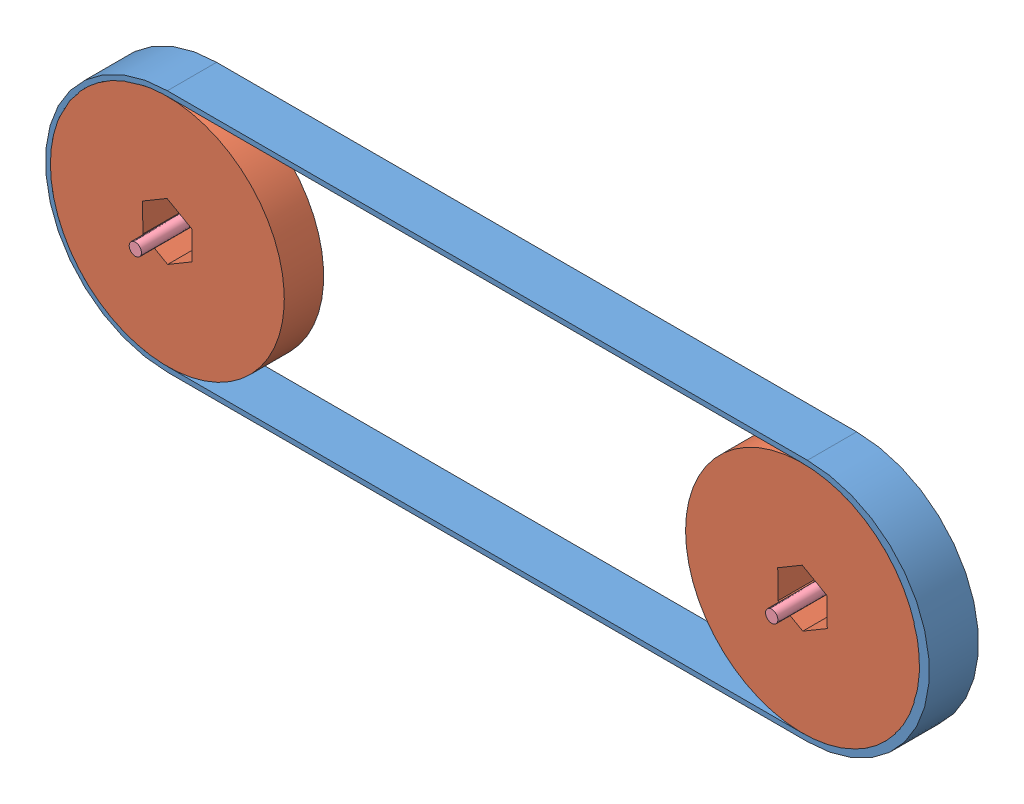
SolidWorks assembly WheelTreads W screws.SLDASM, configuration Default (file format 14000). Lengths in mm.
Overall size (227.97 62.87 20.76).
7 component instances, 4 part files, 9 mates.
Components (placement in the parent):
- RMPTread1-1: RMPTread1.SLDPRT [Default] at (82.774 182.8334 215.74) size (227.97 62.87 12.7)
- RMPWheel1-1: RMPWheel1.SLDPRT [Default] at (82.774 182.8334 218.28) size (60.32 60.32 10.16)
- RMPWheel1-2: RMPWheel1.SLDPRT [Default] at (246.604 182.8334 218.28) size (60.32 60.32 10.16)
- washer 3-4 OD 1-8 ID-1: washer 3-4 OD 1-8 ID.SLDPRT [Default] at (246.7243 182.8785 217.01) x (0.999888 0.014951 0) z (0.014951 -0.999888 0) size (19.05 1.27 19.05)
- washer 3-4 OD 1-8 ID-2: washer 3-4 OD 1-8 ID.SLDPRT [Default] at (82.5739 182.7908 217.01) x (1 0 0) z (0 -1 0) size (19.05 1.27 19.05)
- Screw 1-8in ID .75in length-3: Screw 1-8in ID .75in length.SLDPRT [Default] at (245.1368 182.8785 236.5) x (0 0 1) z (-1 0 0) size (20 8.26 8.26)
- Screw 1-8in ID .75in length-4: Screw 1-8in ID .75in length.SLDPRT [Default] at (80.9864 182.7908 236.5) x (0 0 1) z (-1 0 0) size (20 8.26 8.26)
Mates (geometry in assembly coordinates):
- Concentric1: concentric anti-aligned: cylinder of RMPTread1-1 through (246.604 182.8334 215.74) axis (0 0 1) radius 30.1625; cylinder of RMPWheel1-2 through (246.604 182.8334 228.44) axis (0 0 -1) radius 30.1625
- Coincident1: coincident aligned: plane of RMPTread1-1 through (82.774 182.8334 228.44) normal (0 0 1); plane of RMPWheel1-2 through (246.604 182.8334 228.44) normal (0 0 1)
- Coincident2: coincident anti-aligned: plane of RMPWheel1-2 through (246.604 182.8334 218.28) normal (0 0 -1); circle of washer 3-4 OD 1-8 ID-1
- Coincident3: coincident anti-aligned: plane of RMPWheel1-1 through (82.774 182.8334 218.28) normal (0 0 -1); plane of washer 3-4 OD 1-8 ID-2 through (82.5739 182.7908 218.28) normal (0 0 1)
- Coincident4: coincident aligned: plane of RMPTread1-1 through (82.774 182.8334 228.44) normal (0 0 1); plane of RMPWheel1-1 through (82.774 182.8334 228.44) normal (0 0 1)
- Concentric3: concentric anti-aligned: cylinder of washer 3-4 OD 1-8 ID-1 through (246.7243 182.8785 218.28) axis (0 0 -1) radius 3.175; cylinder of Screw 1-8in ID .75in length-3 through (246.7243 182.8785 236.5) axis (0 0 1) radius 1.5875
- Coincident5: coincident anti-aligned: plane of washer 3-4 OD 1-8 ID-1 through (246.7243 182.8785 217.01) normal (0 0 -1); plane of Screw 1-8in ID .75in length-3 through (245.1368 182.8785 217.01) normal (0 0 1)
- Concentric4: concentric anti-aligned: cylinder of washer 3-4 OD 1-8 ID-2 through (82.5739 182.7908 218.28) axis (0 0 -1) radius 3.175; cylinder of Screw 1-8in ID .75in length-4 through (82.5739 182.7908 236.5) axis (0 0 1) radius 1.5875
- Coincident6: coincident anti-aligned: plane of washer 3-4 OD 1-8 ID-2 through (82.5739 182.7908 217.01) normal (0 0 -1); plane of Screw 1-8in ID .75in length-4 through (80.9864 182.7908 217.01) normal (0 0 1)
